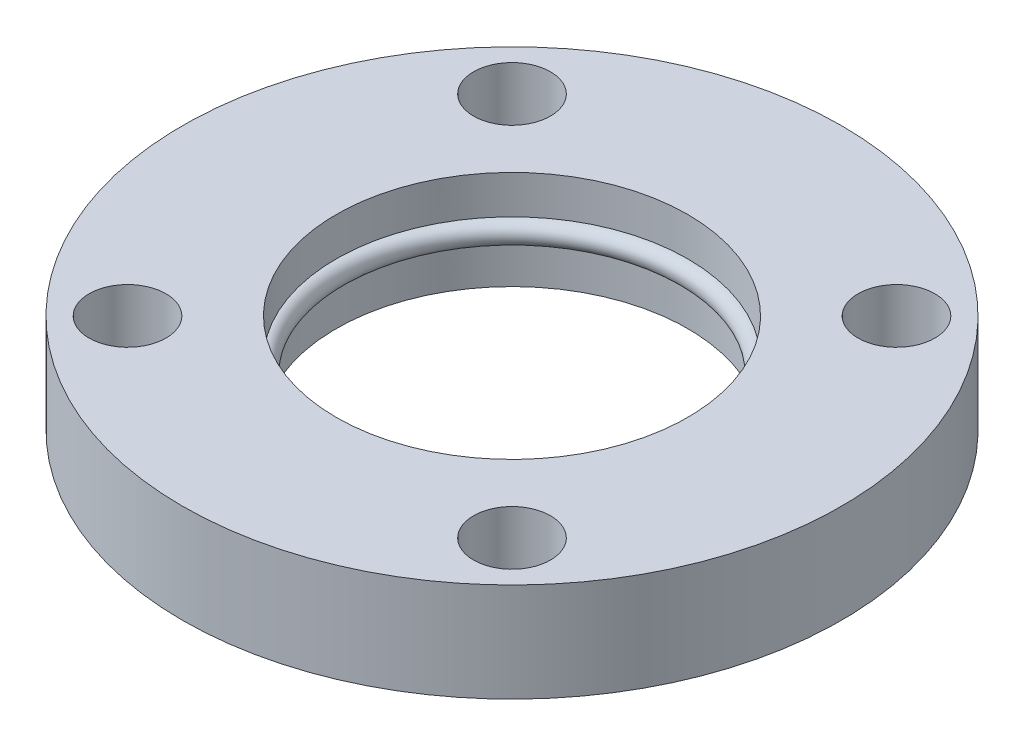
ISO-10303-21;
HEADER;
FILE_DESCRIPTION(('STEP AP214'),'2;1');
FILE_NAME('part.step','',(''),(''),'','','');
FILE_SCHEMA(('AUTOMOTIVE_DESIGN { 1 0 10303 214 1 1 1 1 }'));
ENDSEC;
DATA;
#1=APPLICATION_CONTEXT('core data for automotive mechanical design processes');
#2=APPLICATION_PROTOCOL_DEFINITION('international standard','automotive_design',2000,#1);
#3=PRODUCT_CONTEXT('',#1,'mechanical');
#4=PRODUCT('Part','Part','',(#3));
#5=PRODUCT_RELATED_PRODUCT_CATEGORY('part','',(#4));
#6=PRODUCT_DEFINITION_FORMATION('','',#4);
#7=PRODUCT_DEFINITION_CONTEXT('part definition',#1,'design');
#8=PRODUCT_DEFINITION('design','',#6,#7);
#9=PRODUCT_DEFINITION_SHAPE('','',#8);
#10=(LENGTH_UNIT() NAMED_UNIT(*) SI_UNIT(.MILLI.,.METRE.));
#11=(NAMED_UNIT(*) PLANE_ANGLE_UNIT() SI_UNIT($,.RADIAN.));
#12=(NAMED_UNIT(*) SI_UNIT($,.STERADIAN.) SOLID_ANGLE_UNIT());
#13=UNCERTAINTY_MEASURE_WITH_UNIT(LENGTH_MEASURE(1.E-05),#10,'distance_accuracy_value','');
#14=(GEOMETRIC_REPRESENTATION_CONTEXT(3) GLOBAL_UNCERTAINTY_ASSIGNED_CONTEXT((#13)) GLOBAL_UNIT_ASSIGNED_CONTEXT((#10,
#11,#12)) REPRESENTATION_CONTEXT('',''));
#15=CARTESIAN_POINT('',(0.,0.,0.));
#16=DIRECTION('',(0.,0.,1.));
#17=DIRECTION('',(1.,0.,0.));
#18=AXIS2_PLACEMENT_3D('',#15,#16,#17);
#19=CARTESIAN_POINT('',(0.,4.5,0.));
#20=DIRECTION('',(0.,-1.,0.));
#21=DIRECTION('',(0.,0.,-1.));
#22=AXIS2_PLACEMENT_3D('',#19,#20,#21);
#23=CYLINDRICAL_SURFACE('',#22,16.);
#24=CARTESIAN_POINT('',(0.,-4.5,0.));
#25=DIRECTION('',(0.,1.,0.));
#26=DIRECTION('',(0.,0.,1.));
#27=AXIS2_PLACEMENT_3D('',#24,#25,#26);
#28=CIRCLE('',#27,16.);
#29=CARTESIAN_POINT('',(0.,-4.5,16.));
#30=VERTEX_POINT('',#29);
#31=EDGE_CURVE('E49',#30,#30,#28,.T.);
#32=ORIENTED_EDGE('',*,*,#31,.F.);
#33=EDGE_LOOP('',(#32));
#34=FACE_BOUND('',#33,.T.);
#35=CARTESIAN_POINT('',(0.,-1.,0.));
#36=DIRECTION('',(0.,1.,0.));
#37=DIRECTION('',(0.,0.,1.));
#38=AXIS2_PLACEMENT_3D('',#35,#36,#37);
#39=CIRCLE('',#38,16.);
#40=CARTESIAN_POINT('',(0.,-1.,16.));
#41=VERTEX_POINT('',#40);
#42=EDGE_CURVE('E37',#41,#41,#39,.T.);
#43=ORIENTED_EDGE('',*,*,#42,.T.);
#44=EDGE_LOOP('',(#43));
#45=FACE_BOUND('',#44,.T.);
#46=ADVANCED_FACE('F33',(#34,#45),#23,.F.);
#47=CARTESIAN_POINT('',(0.,4.5,0.));
#48=DIRECTION('',(0.,1.,0.));
#49=DIRECTION('',(0.,0.,1.));
#50=AXIS2_PLACEMENT_3D('',#47,#48,#49);
#51=CIRCLE('',#50,16.);
#52=CARTESIAN_POINT('',(0.,4.5,16.));
#53=VERTEX_POINT('',#52);
#54=EDGE_CURVE('E46',#53,#53,#51,.T.);
#55=ORIENTED_EDGE('',*,*,#54,.T.);
#56=EDGE_LOOP('',(#55));
#57=FACE_BOUND('',#56,.T.);
#58=CARTESIAN_POINT('',(0.,1.,0.));
#59=DIRECTION('',(0.,-1.,0.));
#60=DIRECTION('',(0.,0.,-1.));
#61=AXIS2_PLACEMENT_3D('',#58,#59,#60);
#62=CIRCLE('',#61,16.);
#63=CARTESIAN_POINT('',(0.,1.,-16.));
#64=VERTEX_POINT('',#63);
#65=EDGE_CURVE('E51',#64,#64,#62,.T.);
#66=ORIENTED_EDGE('',*,*,#65,.T.);
#67=EDGE_LOOP('',(#66));
#68=FACE_BOUND('',#67,.T.);
#69=ADVANCED_FACE('F94',(#57,#68),#23,.F.);
#70=CARTESIAN_POINT('',(0.,4.5,0.));
#71=DIRECTION('',(0.,1.,0.));
#72=DIRECTION('',(0.,0.,1.));
#73=AXIS2_PLACEMENT_3D('',#70,#71,#72);
#74=PLANE('',#73);
#75=CARTESIAN_POINT('',(17.5,4.5,17.5));
#76=DIRECTION('',(0.,1.,0.));
#77=DIRECTION('',(0.,0.,1.));
#78=AXIS2_PLACEMENT_3D('',#75,#76,#77);
#79=CIRCLE('',#78,3.5);
#80=CARTESIAN_POINT('',(17.5,4.5,21.));
#81=VERTEX_POINT('',#80);
#82=EDGE_CURVE('E68',#81,#81,#79,.T.);
#83=ORIENTED_EDGE('',*,*,#82,.F.);
#84=EDGE_LOOP('',(#83));
#85=FACE_BOUND('',#84,.T.);
#86=CARTESIAN_POINT('',(-17.5,4.5,-17.5));
#87=DIRECTION('',(0.,1.,0.));
#88=DIRECTION('',(0.,0.,1.));
#89=AXIS2_PLACEMENT_3D('',#86,#87,#88);
#90=CIRCLE('',#89,3.5);
#91=CARTESIAN_POINT('',(-17.5,4.5,-14.));
#92=VERTEX_POINT('',#91);
#93=EDGE_CURVE('E80',#92,#92,#90,.T.);
#94=ORIENTED_EDGE('',*,*,#93,.F.);
#95=EDGE_LOOP('',(#94));
#96=FACE_BOUND('',#95,.T.);
#97=CARTESIAN_POINT('',(0.,4.5,0.));
#98=DIRECTION('',(0.,1.,0.));
#99=DIRECTION('',(0.,0.,1.));
#100=AXIS2_PLACEMENT_3D('',#97,#98,#99);
#101=CIRCLE('',#100,30.);
#102=CARTESIAN_POINT('',(0.,4.5,30.));
#103=VERTEX_POINT('',#102);
#104=EDGE_CURVE('E10',#103,#103,#101,.T.);
#105=ORIENTED_EDGE('',*,*,#104,.T.);
#106=EDGE_LOOP('',(#105));
#107=FACE_BOUND('',#106,.T.);
#108=ORIENTED_EDGE('',*,*,#54,.F.);
#109=EDGE_LOOP('',(#108));
#110=FACE_BOUND('',#109,.T.);
#111=CARTESIAN_POINT('',(17.5,4.5,-17.5));
#112=DIRECTION('',(0.,1.,0.));
#113=DIRECTION('',(0.,0.,1.));
#114=AXIS2_PLACEMENT_3D('',#111,#112,#113);
#115=CIRCLE('',#114,3.5);
#116=CARTESIAN_POINT('',(17.5,4.5,-14.));
#117=VERTEX_POINT('',#116);
#118=EDGE_CURVE('E74',#117,#117,#115,.T.);
#119=ORIENTED_EDGE('',*,*,#118,.F.);
#120=EDGE_LOOP('',(#119));
#121=FACE_BOUND('',#120,.T.);
#122=CARTESIAN_POINT('',(-17.5,4.5,17.5));
#123=DIRECTION('',(0.,1.,0.));
#124=DIRECTION('',(0.,0.,1.));
#125=AXIS2_PLACEMENT_3D('',#122,#123,#124);
#126=CIRCLE('',#125,3.5);
#127=CARTESIAN_POINT('',(-17.5,4.5,21.));
#128=VERTEX_POINT('',#127);
#129=EDGE_CURVE('E60',#128,#128,#126,.T.);
#130=ORIENTED_EDGE('',*,*,#129,.F.);
#131=EDGE_LOOP('',(#130));
#132=FACE_BOUND('',#131,.T.);
#133=ADVANCED_FACE('F99',(#85,#96,#107,#110,#121,#132),#74,.T.);
#134=CARTESIAN_POINT('',(0.,-4.5,0.));
#135=DIRECTION('',(0.,1.,0.));
#136=DIRECTION('',(0.,0.,1.));
#137=AXIS2_PLACEMENT_3D('',#134,#135,#136);
#138=PLANE('',#137);
#139=CARTESIAN_POINT('',(0.,-4.5,0.));
#140=DIRECTION('',(0.,1.,0.));
#141=DIRECTION('',(0.,0.,1.));
#142=AXIS2_PLACEMENT_3D('',#139,#140,#141);
#143=CIRCLE('',#142,30.);
#144=CARTESIAN_POINT('',(0.,-4.5,30.));
#145=VERTEX_POINT('',#144);
#146=EDGE_CURVE('E41',#145,#145,#143,.T.);
#147=ORIENTED_EDGE('',*,*,#146,.F.);
#148=EDGE_LOOP('',(#147));
#149=FACE_BOUND('',#148,.T.);
#150=ORIENTED_EDGE('',*,*,#31,.T.);
#151=EDGE_LOOP('',(#150));
#152=FACE_BOUND('',#151,.T.);
#153=CARTESIAN_POINT('',(-17.5,-4.5,-17.5));
#154=DIRECTION('',(0.,1.,0.));
#155=DIRECTION('',(0.,0.,1.));
#156=AXIS2_PLACEMENT_3D('',#153,#154,#155);
#157=CIRCLE('',#156,3.5);
#158=CARTESIAN_POINT('',(-17.5,-4.5,-14.));
#159=VERTEX_POINT('',#158);
#160=EDGE_CURVE('E77',#159,#159,#157,.T.);
#161=ORIENTED_EDGE('',*,*,#160,.T.);
#162=EDGE_LOOP('',(#161));
#163=FACE_BOUND('',#162,.T.);
#164=CARTESIAN_POINT('',(17.5,-4.5,-17.5));
#165=DIRECTION('',(0.,1.,0.));
#166=DIRECTION('',(0.,0.,1.));
#167=AXIS2_PLACEMENT_3D('',#164,#165,#166);
#168=CIRCLE('',#167,3.5);
#169=CARTESIAN_POINT('',(17.5,-4.5,-14.));
#170=VERTEX_POINT('',#169);
#171=EDGE_CURVE('E71',#170,#170,#168,.T.);
#172=ORIENTED_EDGE('',*,*,#171,.T.);
#173=EDGE_LOOP('',(#172));
#174=FACE_BOUND('',#173,.T.);
#175=CARTESIAN_POINT('',(17.5,-4.5,17.5));
#176=DIRECTION('',(0.,1.,0.));
#177=DIRECTION('',(0.,0.,1.));
#178=AXIS2_PLACEMENT_3D('',#175,#176,#177);
#179=CIRCLE('',#178,3.5);
#180=CARTESIAN_POINT('',(17.5,-4.5,21.));
#181=VERTEX_POINT('',#180);
#182=EDGE_CURVE('E65',#181,#181,#179,.T.);
#183=ORIENTED_EDGE('',*,*,#182,.T.);
#184=EDGE_LOOP('',(#183));
#185=FACE_BOUND('',#184,.T.);
#186=CARTESIAN_POINT('',(-17.5,-4.5,17.5));
#187=DIRECTION('',(0.,1.,0.));
#188=DIRECTION('',(0.,0.,1.));
#189=AXIS2_PLACEMENT_3D('',#186,#187,#188);
#190=CIRCLE('',#189,3.5);
#191=CARTESIAN_POINT('',(-17.5,-4.5,21.));
#192=VERTEX_POINT('',#191);
#193=EDGE_CURVE('E56',#192,#192,#190,.T.);
#194=ORIENTED_EDGE('',*,*,#193,.T.);
#195=EDGE_LOOP('',(#194));
#196=FACE_BOUND('',#195,.T.);
#197=ADVANCED_FACE('F90',(#149,#152,#163,#174,#185,#196),#138,.F.);
#198=CARTESIAN_POINT('',(0.,4.5,0.));
#199=DIRECTION('',(0.,-1.,0.));
#200=DIRECTION('',(0.,0.,-1.));
#201=AXIS2_PLACEMENT_3D('',#198,#199,#200);
#202=CYLINDRICAL_SURFACE('',#201,30.);
#203=ORIENTED_EDGE('',*,*,#104,.F.);
#204=EDGE_LOOP('',(#203));
#205=FACE_BOUND('',#204,.T.);
#206=ORIENTED_EDGE('',*,*,#146,.T.);
#207=EDGE_LOOP('',(#206));
#208=FACE_BOUND('',#207,.T.);
#209=ADVANCED_FACE('F35',(#205,#208),#202,.T.);
#210=CARTESIAN_POINT('',(-17.5,4.5,-17.5));
#211=DIRECTION('',(0.,-1.,0.));
#212=DIRECTION('',(0.,0.,-1.));
#213=AXIS2_PLACEMENT_3D('',#210,#211,#212);
#214=CYLINDRICAL_SURFACE('',#213,3.5);
#215=ORIENTED_EDGE('',*,*,#93,.T.);
#216=EDGE_LOOP('',(#215));
#217=FACE_BOUND('',#216,.T.);
#218=ORIENTED_EDGE('',*,*,#160,.F.);
#219=EDGE_LOOP('',(#218));
#220=FACE_BOUND('',#219,.T.);
#221=ADVANCED_FACE('F102',(#217,#220),#214,.F.);
#222=CARTESIAN_POINT('',(17.5,4.5,-17.5));
#223=DIRECTION('',(0.,-1.,0.));
#224=DIRECTION('',(0.,0.,-1.));
#225=AXIS2_PLACEMENT_3D('',#222,#223,#224);
#226=CYLINDRICAL_SURFACE('',#225,3.5);
#227=ORIENTED_EDGE('',*,*,#118,.T.);
#228=EDGE_LOOP('',(#227));
#229=FACE_BOUND('',#228,.T.);
#230=ORIENTED_EDGE('',*,*,#171,.F.);
#231=EDGE_LOOP('',(#230));
#232=FACE_BOUND('',#231,.T.);
#233=ADVANCED_FACE('F117',(#229,#232),#226,.F.);
#234=CARTESIAN_POINT('',(17.5,4.5,17.5));
#235=DIRECTION('',(0.,-1.,0.));
#236=DIRECTION('',(0.,0.,-1.));
#237=AXIS2_PLACEMENT_3D('',#234,#235,#236);
#238=CYLINDRICAL_SURFACE('',#237,3.5);
#239=ORIENTED_EDGE('',*,*,#82,.T.);
#240=EDGE_LOOP('',(#239));
#241=FACE_BOUND('',#240,.T.);
#242=ORIENTED_EDGE('',*,*,#182,.F.);
#243=EDGE_LOOP('',(#242));
#244=FACE_BOUND('',#243,.T.);
#245=ADVANCED_FACE('F122',(#241,#244),#238,.F.);
#246=CARTESIAN_POINT('',(-17.5,4.5,17.5));
#247=DIRECTION('',(0.,-1.,0.));
#248=DIRECTION('',(0.,0.,-1.));
#249=AXIS2_PLACEMENT_3D('',#246,#247,#248);
#250=CYLINDRICAL_SURFACE('',#249,3.5);
#251=ORIENTED_EDGE('',*,*,#129,.T.);
#252=EDGE_LOOP('',(#251));
#253=FACE_BOUND('',#252,.T.);
#254=ORIENTED_EDGE('',*,*,#193,.F.);
#255=EDGE_LOOP('',(#254));
#256=FACE_BOUND('',#255,.T.);
#257=ADVANCED_FACE('F133',(#253,#256),#250,.F.);
#258=CARTESIAN_POINT('',(0.,0.,0.));
#259=DIRECTION('',(0.,-1.,0.));
#260=DIRECTION('',(0.,0.,-1.));
#261=AXIS2_PLACEMENT_3D('',#258,#259,#260);
#262=TOROIDAL_SURFACE('',#261,16.,1.);
#263=ORIENTED_EDGE('',*,*,#65,.F.);
#264=EDGE_LOOP('',(#263));
#265=FACE_BOUND('',#264,.T.);
#266=ORIENTED_EDGE('',*,*,#42,.F.);
#267=EDGE_LOOP('',(#266));
#268=FACE_BOUND('',#267,.T.);
#269=ADVANCED_FACE('F139',(#265,#268),#262,.T.);
#270=CLOSED_SHELL('',(#46,#69,#133,#197,#209,#221,#233,#245,#257,#269));
#271=MANIFOLD_SOLID_BREP('B2',#270);
#272=ADVANCED_BREP_SHAPE_REPRESENTATION('',(#18,#271),#14);
#273=SHAPE_DEFINITION_REPRESENTATION(#9,#272);
ENDSEC;
END-ISO-10303-21;
